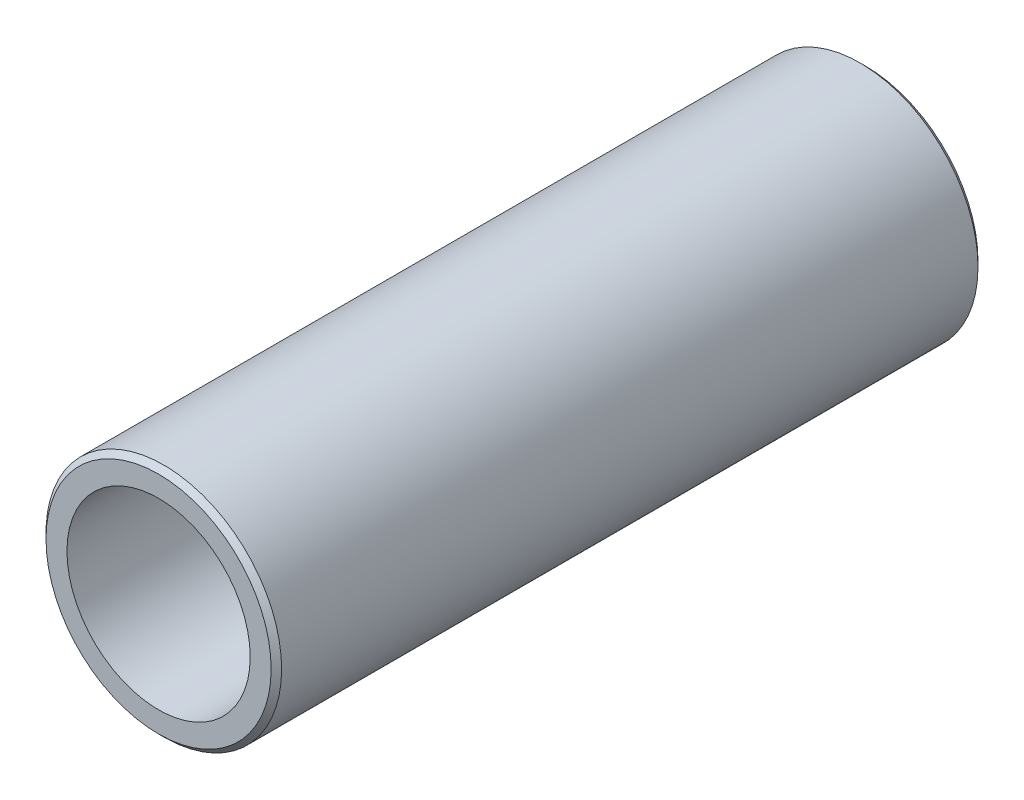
ISO-10303-21;
HEADER;
FILE_DESCRIPTION(('STEP AP214'),'2;1');
FILE_NAME('part.step','',(''),(''),'','','');
FILE_SCHEMA(('AUTOMOTIVE_DESIGN { 1 0 10303 214 1 1 1 1 }'));
ENDSEC;
DATA;
#1=APPLICATION_CONTEXT('core data for automotive mechanical design processes');
#2=APPLICATION_PROTOCOL_DEFINITION('international standard','automotive_design',2000,#1);
#3=PRODUCT_CONTEXT('',#1,'mechanical');
#4=PRODUCT('Part','Part','',(#3));
#5=PRODUCT_RELATED_PRODUCT_CATEGORY('part','',(#4));
#6=PRODUCT_DEFINITION_FORMATION('','',#4);
#7=PRODUCT_DEFINITION_CONTEXT('part definition',#1,'design');
#8=PRODUCT_DEFINITION('design','',#6,#7);
#9=PRODUCT_DEFINITION_SHAPE('','',#8);
#10=(LENGTH_UNIT() NAMED_UNIT(*) SI_UNIT(.MILLI.,.METRE.));
#11=(NAMED_UNIT(*) PLANE_ANGLE_UNIT() SI_UNIT($,.RADIAN.));
#12=(NAMED_UNIT(*) SI_UNIT($,.STERADIAN.) SOLID_ANGLE_UNIT());
#13=UNCERTAINTY_MEASURE_WITH_UNIT(LENGTH_MEASURE(1.E-05),#10,'distance_accuracy_value','');
#14=(GEOMETRIC_REPRESENTATION_CONTEXT(3) GLOBAL_UNCERTAINTY_ASSIGNED_CONTEXT((#13)) GLOBAL_UNIT_ASSIGNED_CONTEXT((#10,
#11,#12)) REPRESENTATION_CONTEXT('',''));
#15=CARTESIAN_POINT('',(0.,0.,0.));
#16=DIRECTION('',(0.,0.,1.));
#17=DIRECTION('',(1.,0.,0.));
#18=AXIS2_PLACEMENT_3D('',#15,#16,#17);
#19=CARTESIAN_POINT('',(-20.5,0.,-27.));
#20=DIRECTION('',(0.,0.,1.));
#21=DIRECTION('',(1.,0.,0.));
#22=AXIS2_PLACEMENT_3D('',#19,#20,#21);
#23=CYLINDRICAL_SURFACE('',#22,4.5);
#24=CARTESIAN_POINT('',(-20.5,0.,-0.200000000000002));
#25=DIRECTION('',(0.,0.,1.));
#26=DIRECTION('',(1.,0.,0.));
#27=AXIS2_PLACEMENT_3D('',#24,#25,#26);
#28=CIRCLE('',#27,4.5);
#29=CARTESIAN_POINT('',(-16.,0.,-0.200000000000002));
#30=VERTEX_POINT('',#29);
#31=EDGE_CURVE('E38',#30,#30,#28,.F.);
#32=ORIENTED_EDGE('',*,*,#31,.T.);
#33=EDGE_LOOP('',(#32));
#34=FACE_BOUND('',#33,.T.);
#35=CARTESIAN_POINT('',(-20.5,0.,-26.8));
#36=DIRECTION('',(0.,0.,1.));
#37=DIRECTION('',(1.,0.,0.));
#38=AXIS2_PLACEMENT_3D('',#35,#36,#37);
#39=CIRCLE('',#38,4.5);
#40=CARTESIAN_POINT('',(-16.,0.,-26.8));
#41=VERTEX_POINT('',#40);
#42=EDGE_CURVE('E42',#41,#41,#39,.T.);
#43=ORIENTED_EDGE('',*,*,#42,.T.);
#44=EDGE_LOOP('',(#43));
#45=FACE_BOUND('',#44,.T.);
#46=ADVANCED_FACE('F31',(#34,#45),#23,.T.);
#47=CARTESIAN_POINT('',(-20.5,0.,-27.));
#48=DIRECTION('',(0.,0.,1.));
#49=DIRECTION('',(1.,0.,0.));
#50=AXIS2_PLACEMENT_3D('',#47,#48,#49);
#51=PLANE('',#50);
#52=CARTESIAN_POINT('',(-20.5,0.,-27.));
#53=DIRECTION('',(0.,0.,1.));
#54=DIRECTION('',(1.,0.,0.));
#55=AXIS2_PLACEMENT_3D('',#52,#53,#54);
#56=CIRCLE('',#55,4.3);
#57=CARTESIAN_POINT('',(-16.2,0.,-27.));
#58=VERTEX_POINT('',#57);
#59=EDGE_CURVE('E10',#58,#58,#56,.F.);
#60=ORIENTED_EDGE('',*,*,#59,.T.);
#61=EDGE_LOOP('',(#60));
#62=FACE_BOUND('',#61,.T.);
#63=CARTESIAN_POINT('',(-20.5,0.,-27.));
#64=DIRECTION('',(0.,0.,1.));
#65=DIRECTION('',(1.,0.,0.));
#66=AXIS2_PLACEMENT_3D('',#63,#64,#65);
#67=CIRCLE('',#66,3.5);
#68=CARTESIAN_POINT('',(-17.,0.,-27.));
#69=VERTEX_POINT('',#68);
#70=EDGE_CURVE('E51',#69,#69,#67,.T.);
#71=ORIENTED_EDGE('',*,*,#70,.T.);
#72=EDGE_LOOP('',(#71));
#73=FACE_BOUND('',#72,.T.);
#74=ADVANCED_FACE('F58',(#62,#73),#51,.F.);
#75=CARTESIAN_POINT('',(-20.5,0.,0.));
#76=DIRECTION('',(0.,0.,1.));
#77=DIRECTION('',(1.,0.,0.));
#78=AXIS2_PLACEMENT_3D('',#75,#76,#77);
#79=PLANE('',#78);
#80=CARTESIAN_POINT('',(-20.5,0.,0.));
#81=DIRECTION('',(0.,0.,1.));
#82=DIRECTION('',(1.,0.,0.));
#83=AXIS2_PLACEMENT_3D('',#80,#81,#82);
#84=CIRCLE('',#83,4.3);
#85=CARTESIAN_POINT('',(-16.2,0.,0.));
#86=VERTEX_POINT('',#85);
#87=EDGE_CURVE('E46',#86,#86,#84,.T.);
#88=ORIENTED_EDGE('',*,*,#87,.T.);
#89=EDGE_LOOP('',(#88));
#90=FACE_BOUND('',#89,.T.);
#91=CARTESIAN_POINT('',(-20.5,0.,0.));
#92=DIRECTION('',(0.,0.,1.));
#93=DIRECTION('',(1.,0.,0.));
#94=AXIS2_PLACEMENT_3D('',#91,#92,#93);
#95=CIRCLE('',#94,3.5);
#96=CARTESIAN_POINT('',(-17.,0.,0.));
#97=VERTEX_POINT('',#96);
#98=EDGE_CURVE('E52',#97,#97,#95,.T.);
#99=ORIENTED_EDGE('',*,*,#98,.F.);
#100=EDGE_LOOP('',(#99));
#101=FACE_BOUND('',#100,.T.);
#102=ADVANCED_FACE('F64',(#90,#101),#79,.T.);
#103=CARTESIAN_POINT('',(-20.5,0.,-27.));
#104=DIRECTION('',(0.,0.,1.));
#105=DIRECTION('',(1.,0.,0.));
#106=AXIS2_PLACEMENT_3D('',#103,#104,#105);
#107=CYLINDRICAL_SURFACE('',#106,3.5);
#108=ORIENTED_EDGE('',*,*,#70,.F.);
#109=EDGE_LOOP('',(#108));
#110=FACE_BOUND('',#109,.T.);
#111=ORIENTED_EDGE('',*,*,#98,.T.);
#112=EDGE_LOOP('',(#111));
#113=FACE_BOUND('',#112,.T.);
#114=ADVANCED_FACE('F60',(#110,#113),#107,.F.);
#115=CARTESIAN_POINT('',(-20.5,0.,0.));
#116=DIRECTION('',(0.,0.,-1.));
#117=DIRECTION('',(-1.,0.,0.));
#118=AXIS2_PLACEMENT_3D('',#115,#116,#117);
#119=CONICAL_SURFACE('',#118,4.3,0.78539816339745);
#120=ORIENTED_EDGE('',*,*,#31,.F.);
#121=EDGE_LOOP('',(#120));
#122=FACE_BOUND('',#121,.T.);
#123=ORIENTED_EDGE('',*,*,#87,.F.);
#124=EDGE_LOOP('',(#123));
#125=FACE_BOUND('',#124,.T.);
#126=ADVANCED_FACE('F63',(#122,#125),#119,.T.);
#127=CARTESIAN_POINT('',(-20.5,0.,-26.8));
#128=DIRECTION('',(0.,0.,1.));
#129=DIRECTION('',(1.,0.,0.));
#130=AXIS2_PLACEMENT_3D('',#127,#128,#129);
#131=CONICAL_SURFACE('',#130,4.5,0.785398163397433);
#132=ORIENTED_EDGE('',*,*,#59,.F.);
#133=EDGE_LOOP('',(#132));
#134=FACE_BOUND('',#133,.T.);
#135=ORIENTED_EDGE('',*,*,#42,.F.);
#136=EDGE_LOOP('',(#135));
#137=FACE_BOUND('',#136,.T.);
#138=ADVANCED_FACE('F33',(#134,#137),#131,.T.);
#139=CLOSED_SHELL('',(#46,#74,#102,#114,#126,#138));
#140=MANIFOLD_SOLID_BREP('B2',#139);
#141=ADVANCED_BREP_SHAPE_REPRESENTATION('',(#18,#140),#14);
#142=SHAPE_DEFINITION_REPRESENTATION(#9,#141);
ENDSEC;
END-ISO-10303-21;
